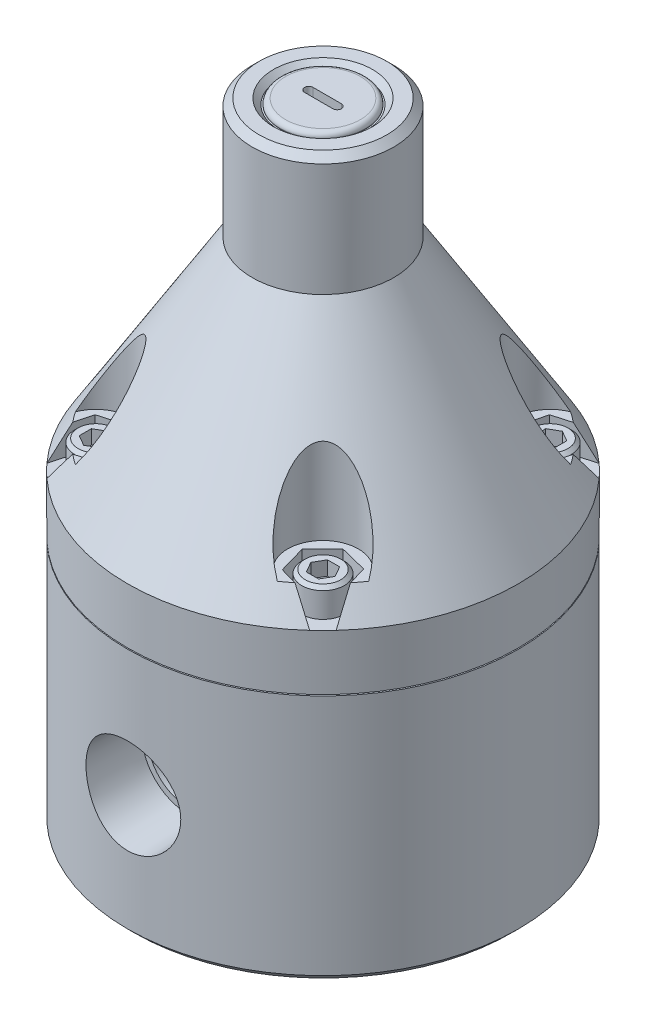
from build123d import *

# Parameters (mm, degrees)
SKETCH1_R         = 43.815
EXTRUDE1_DEPTH    = 140.97
SKETCH3_R         = 11.1125
EXTRUDE2_DEPTH    = 1.27
EXTRUDE2_DRAFT    = -45
CHAMFER1_SIZE     = 1.5748
SKETCH4_R         = 9.525
EXTRUDE3_DEPTH    = 1.27
FILLET1_R         = 1.143
EXTRUDE4_DEPTH    = 3.302
EXTRUDE4_DRAFT    = -1
SKETCH6_R         = 7.9375
EXTRUDE5_DEPTH    = 22.86
EXTRUDE6_DEPTH    = 6.35
CIRPATTERN1_COUNT = 4
SKETCH9_R         = 4.7625
EXTRUDE7_DEPTH    = 6.35
EXTRUDE8_DEPTH    = 3.175
CIRPATTERN2_COUNT = 4
CHAMFER2_SIZE     = 0.762


with BuildPart() as part:
    # Sketch1 → Extrude1 (new body)
    with BuildSketch(Plane(origin=(0, 0, 0), x_dir=(1, 0, 0), z_dir=(0, 1, 0))):
        with Locations(Location((0, 0, 0), (0, 0, 270))):
            Circle(SKETCH1_R)
    extrude(amount=EXTRUDE1_DEPTH)

    # Sketch2 → Cut-Revolve1 (revolve, cut)
    with BuildSketch(Plane.XY, mode=Mode.PRIVATE) as cut_revolve1_sk:
        Polygon((-43.815, 56.134), (-43.815, 68.58), (-15.875, 114.046), (-15.875, 147.034008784), (-49.44729897, 147.034008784), (-49.44729897, 55.88), (-30.226, 55.88), (-30.226, 56.134), align=None)
    revolve(cut_revolve1_sk.sketch.rotate(Axis((0, 0, 0), (0, 1, 0)), 270), axis=Axis((0, 0, 0), (0, 1, 0)), mode=Mode.SUBTRACT)


with BuildPart() as extrude2_tool:
    # Sketch3 → Extrude2 (with draft: the straight prism first)
    with BuildSketch(Plane(origin=(0, 140.97, 0), x_dir=(-1, 0, 0), z_dir=(0, 1, 0))):
        Circle(SKETCH3_R)
    extrude(amount=-EXTRUDE2_DEPTH)
    # Extrude2: the draft: its side faces are tilted about the plane it starts from
    extrude2_sides = [extrude2_tool.faces().sort_by_distance(p)[0] for p in [
        (11.1125, 140.335, 0),
    ]]
    draft(extrude2_sides, Plane(origin=(0, 140.97, 0), x_dir=(-1, 0, 0), z_dir=(0, 1, 0)), EXTRUDE2_DRAFT)


with BuildPart() as part_1:
    add(part.part)

    # Extrude2: cut by extrude2_tool
    add(extrude2_tool.part, mode=Mode.SUBTRACT)

    # Chamfer1
    chamfer1_edges = [part_1.edges().sort_by_distance(p)[0] for p in [
        (0, 0, -43.815),
        (0, 140.97, 15.875),
    ]]
    chamfer(chamfer1_edges, length=CHAMFER1_SIZE)

    # Sketch4 → Extrude3 (add)
    with BuildSketch(Plane(origin=(0, 140.97, 0), x_dir=(-1, 0, 0), z_dir=(0, 1, 0))):
        with Locations(Location((0, 0, 0), (0, 0, 90))):
            Circle(SKETCH4_R)
    extrude(amount=-EXTRUDE3_DEPTH)

    # Fillet1
    fillet1_edges = [part_1.edges().sort_by_distance(p)[0] for p in [
        (0, 140.97, -9.525),
    ]]
    fillet(fillet1_edges, radius=FILLET1_R)


with BuildPart() as extrude4_tool:
    # Sketch5 → Extrude4 (with draft: the straight prism first)
    with BuildSketch(Plane(origin=(0, 140.97, 0), x_dir=(-1, 0, 0), z_dir=(0, 1, 0))):
        with BuildLine():
            Line((3.175, 0.9652), (-3.175, 0.9652))
            ThreePointArc((-3.175, 0.9652), (-4.1402, 0), (-3.175, -0.9652))
            Line((-3.175, -0.9652), (3.175, -0.9652))
            ThreePointArc((3.175, -0.9652), (4.1402, 0), (3.175, 0.9652))
        make_face()
    extrude(amount=-EXTRUDE4_DEPTH)
    # Extrude4: the draft: its side faces are tilted about the plane it starts from
    extrude4_sides = [extrude4_tool.faces().sort_by_distance(p)[0] for p in [
        (-4.1402, 139.319, 0),
        (0, 139.319, 0.9652),
        (4.1402, 139.319, 0),
        (0, 139.319, -0.9652),
    ]]
    draft(extrude4_sides, Plane(origin=(0, 140.97, 0), x_dir=(-1, 0, 0), z_dir=(0, 1, 0)), EXTRUDE4_DRAFT)


with BuildPart() as part_2:
    add(part_1.part)

    # Extrude4: cut by extrude4_tool
    add(extrude4_tool.part, mode=Mode.SUBTRACT)

    # Sketch6 → Extrude5 (cut)
    with BuildSketch(Plane(origin=(0, 74.93, 0), x_dir=(-1, 0, 0), z_dir=(0, 1, 0))):
        with Locations((-25.459026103, 25.459026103)):
            Circle(SKETCH6_R)
    extrude5 = extrude(amount=EXTRUDE5_DEPTH, mode=Mode.SUBTRACT)

    # Sketch8 → Extrude6 (cut)
    with BuildSketch(Plane(origin=(0, 74.93, 0), x_dir=(-1, 0, 0), z_dir=(0, 1, 0))):
        Polygon((-29.948607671, 20.824591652), (-23.690278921, 19.253717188), (-19.200697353, 23.888151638), (-20.969444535, 30.093460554), (-33.591654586, 33.591654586), align=None)
    extrude6 = extrude(amount=-EXTRUDE6_DEPTH, mode=Mode.SUBTRACT)

    # CirPattern1: Extrude5, Extrude6 ×4 about axis
    cirpattern1_axis = Axis((0, 0, 0), (0, 1, 0))
    add([extrude5.rotate(cirpattern1_axis, i * 360 / CIRPATTERN1_COUNT) for i in range(1, CIRPATTERN1_COUNT)], mode=Mode.SUBTRACT)
    add([extrude6.rotate(cirpattern1_axis, i * 360 / CIRPATTERN1_COUNT) for i in range(1, CIRPATTERN1_COUNT)], mode=Mode.SUBTRACT)

    # Sketch9 → Extrude7 (add)
    with BuildSketch(Plane(origin=(0, 74.93, 0), x_dir=(-1, 0, 0), z_dir=(0, 1, 0))):
        with Locations(Location((-25.459026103, 25.459026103, 0), (0, 0, 90))):
            Circle(SKETCH9_R)
    extrude7 = extrude(amount=-EXTRUDE7_DEPTH)

    # Sketch10 → Extrude8 (cut)
    with BuildSketch(Plane(origin=(0, 74.93, 0), x_dir=(-1, 0, 0), z_dir=(0, 1, 0))):
        Polygon((-28.187127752, 25.459026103), (-26.823076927, 23.096420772), (-24.094975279, 23.096420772), (-22.730924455, 25.459026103), (-24.094975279, 27.821631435), (-26.823076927, 27.821631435), align=None)
    extrude8 = extrude(amount=-EXTRUDE8_DEPTH, mode=Mode.SUBTRACT)

    # CirPattern2: Extrude7, Extrude8 ×4 about axis
    cirpattern2_axis = Axis((0, 0, 0), (0, 1, 0))
    add([extrude7.rotate(cirpattern2_axis, i * 360 / CIRPATTERN2_COUNT) for i in range(1, CIRPATTERN2_COUNT)])
    add([extrude8.rotate(cirpattern2_axis, i * 360 / CIRPATTERN2_COUNT) for i in range(1, CIRPATTERN2_COUNT)], mode=Mode.SUBTRACT)

    # Chamfer2
    chamfer2_edges = [part_2.edges().sort_by_distance(p)[0] for p in [
        (25.459026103, 74.93, 20.696526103),
        (-20.696526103, 74.93, 25.459026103),
        (-25.459026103, 74.93, -20.696526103),
        (20.696526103, 74.93, -25.459026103),
    ]]
    chamfer(chamfer2_edges, length=CHAMFER2_SIZE)

    # Sketch14 → 1_2 NPT Tapped Hole4 (revolve, cut)
    with BuildSketch(Plane(origin=(0, 27.432, 43.815), x_dir=(0, -1, 0), z_dir=(1, 0, 0))):
        Polygon((0, 0), (0, 20.208140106), (8.9281, 16.51), (8.9281, 13.462), (10.261665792, 13.462), (10.6647361, 0), align=None)
    f_1_2_npt_tapped_hole4 = revolve(axis=Axis((0, 27.432, 50.165), (0, 0, -1)), mode=Mode.SUBTRACT)

    # Mirror1: 1_2 NPT Tapped Hole4 across plane
    add(f_1_2_npt_tapped_hole4.mirror(Plane.XY), mode=Mode.SUBTRACT)


solid = part_2.part
